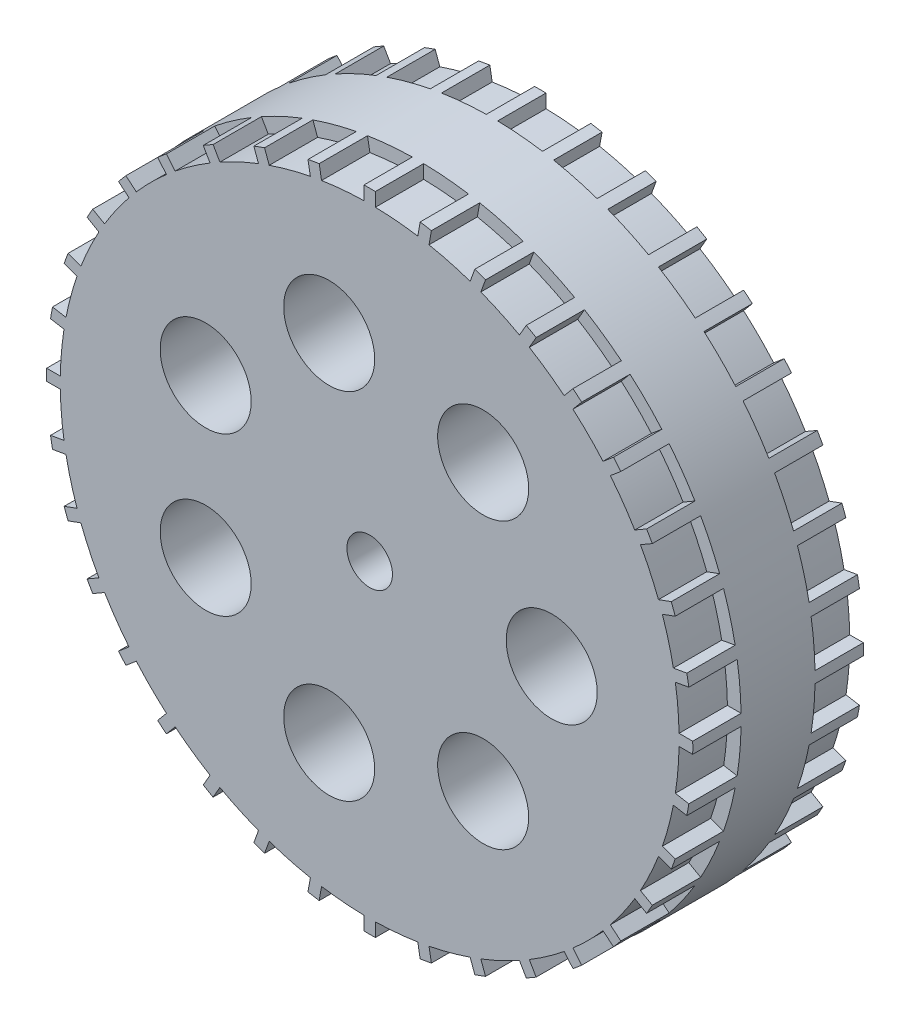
from build123d import *
from build123d.topology import SkipClean

# Parameters (mm, degrees)
SKETCH_1_R          = 27.2
EXTRUDE_1_DEPTH     = 15
CUT_EXTRUDE_1_DEPTH = 10
SKETCH_3_R          = 2
CUT_EXTRUDE_2_DEPTH = 11
SKETCH_6_R          = 4
CUT_EXTRUDE_5_DEPTH = 30
EXTRUDE_START       = -15
EXTRUDE_2_DEPTH     = 15
SKETCH_10_R         = 28.4
SKETCH_10_R_2       = 27.2
EXTRUDE_3_DEPTH     = 3.25


with BuildPart() as part:
    # Sketch 1 → Extrude 1 (new body)
    with BuildSketch(Plane.XY):
        Circle(SKETCH_1_R)
    extrude(amount=EXTRUDE_1_DEPTH)

    # Sketch 2 → Cut-Extrude 1 (cut)
    with BuildSketch(Plane(origin=(0, 0, 0), x_dir=(-1, 0, 0), z_dir=(0, 0, -1))):
        Polygon((7.043673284, 0), (3.521836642, 6.1), (-3.521836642, 6.1), (-7.043673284, 0), (-3.521836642, -6.1), (3.521836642, -6.1), align=None)
    extrude(amount=-CUT_EXTRUDE_1_DEPTH, mode=Mode.SUBTRACT)

    # Sketch 3 → Cut-Extrude 2 (cut)
    with BuildSketch(Plane(origin=(0, 0, 10), x_dir=(-1, 0, 0), z_dir=(0, 0, -1))):
        Circle(SKETCH_3_R)
    extrude(amount=-CUT_EXTRUDE_2_DEPTH, mode=Mode.SUBTRACT)

    # Sketch 6 → Cut-Extrude 5 (cut)
    with BuildSketch(Plane.XY.offset(15)):
        with Locations((16, 0)):
            Circle(SKETCH_6_R)
        with Locations((9.97583683, -12.509303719)):
            Circle(SKETCH_6_R)
        with Locations((-3.560334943, -15.598846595)):
            Circle(SKETCH_6_R)
        with Locations((-14.415501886, -6.942139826)):
            Circle(SKETCH_6_R)
        with Locations((-14.415501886, 6.942139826)):
            Circle(SKETCH_6_R)
        with Locations((-3.560334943, 15.598846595)):
            Circle(SKETCH_6_R)
        with Locations((9.97583683, 12.509303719)):
            Circle(SKETCH_6_R)
    extrude(amount=-CUT_EXTRUDE_5_DEPTH, mode=Mode.SUBTRACT)

    # Sketch 7 → Extrude 2 (add)
    with BuildSketch(Plane.XY.offset(15).offset(EXTRUDE_START)):
        with BuildLine():
            Line((-0.5, 28.39559825), (-0.5, 27.195404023))
            ThreePointArc((-0.5, 27.195404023), (0, 27.2), (0.5, 27.195404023))
            Line((0.5, 27.195404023), (0.5, 28.39559825))
            ThreePointArc((0.5, 28.39559825), (0, 28.4), (-0.5, 28.39559825))
        make_face()
        with BuildLine():
            Line((4.438440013, 28.051029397), (4.230028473, 26.869068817))
            ThreePointArc((4.230028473, 26.869068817), (4.723230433, 26.786770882), (5.214836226, 26.69542064))
            Line((5.214836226, 26.69542064), (5.423247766, 27.87738122))
            ThreePointArc((5.423247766, 27.87738122), (4.931608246, 27.968540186), (4.438440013, 28.051029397))
        make_face()
        with BuildLine():
            Line((9.242020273, 26.85414421), (8.831529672, 25.726330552))
            ThreePointArc((8.831529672, 25.726330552), (9.302947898, 25.559639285), (9.771222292, 25.384310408))
            Line((9.771222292, 25.384310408), (10.181712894, 26.512124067))
            ThreePointArc((10.181712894, 26.512124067), (9.71337207, 26.68727043), (9.242020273, 26.85414421))
        make_face()
        with BuildLine():
            Line((13.764786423, 24.841309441), (13.16468931, 23.801910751))
            ThreePointArc((13.16468931, 23.801910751), (13.6, 23.555890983), (14.030714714, 23.301910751))
            Line((14.030714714, 23.301910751), (14.630811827, 24.341309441))
            ThreePointArc((14.630811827, 24.341309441), (14.2, 24.595121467), (13.764786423, 24.841309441))
        make_face()
        with BuildLine():
            Line((17.869316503, 22.073684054), (17.097846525, 21.154281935))
            ThreePointArc((17.097846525, 21.154281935), (17.483822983, 20.836408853), (17.863890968, 20.511494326))
            Line((17.863890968, 20.511494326), (18.635360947, 21.430896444))
            ThreePointArc((18.635360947, 21.430896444), (18.255168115, 21.755662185), (17.869316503, 22.073684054))
        make_face()
        with BuildLine():
            Line((21.430896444, 18.635360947), (20.511494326, 17.863890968))
            ThreePointArc((20.511494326, 17.863890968), (20.836408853, 17.483822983), (21.154281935, 17.097846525))
            Line((21.154281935, 17.097846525), (22.073684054, 17.869316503))
            ThreePointArc((22.073684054, 17.869316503), (21.755662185, 18.255168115), (21.430896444, 18.635360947))
        make_face()
        with BuildLine():
            Line((24.341309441, 14.630811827), (23.301910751, 14.030714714))
            ThreePointArc((23.301910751, 14.030714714), (23.555890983, 13.6), (23.801910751, 13.16468931))
            Line((23.801910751, 13.16468931), (24.841309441, 13.764786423))
            ThreePointArc((24.841309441, 13.764786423), (24.595121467, 14.2), (24.341309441, 14.630811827))
        make_face()
        with BuildLine():
            Line((26.512124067, 10.181712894), (25.384310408, 9.771222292))
            ThreePointArc((25.384310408, 9.771222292), (25.559639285, 9.302947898), (25.726330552, 8.831529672))
            Line((25.726330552, 8.831529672), (26.85414421, 9.242020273))
            ThreePointArc((26.85414421, 9.242020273), (26.68727043, 9.71337207), (26.512124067, 10.181712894))
        make_face()
        with BuildLine():
            Line((27.87738122, 5.423247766), (26.69542064, 5.214836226))
            ThreePointArc((26.69542064, 5.214836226), (26.786770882, 4.723230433), (26.869068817, 4.230028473))
            Line((26.869068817, 4.230028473), (28.051029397, 4.438440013))
            ThreePointArc((28.051029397, 4.438440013), (27.968540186, 4.931608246), (27.87738122, 5.423247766))
        make_face()
        with BuildLine():
            Line((28.39559825, 0.5), (27.195404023, 0.5))
            ThreePointArc((27.195404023, 0.5), (27.2, 0), (27.195404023, -0.5))
            Line((27.195404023, -0.5), (28.39559825, -0.5))
            ThreePointArc((28.39559825, -0.5), (28.4, 0), (28.39559825, 0.5))
        make_face()
        with BuildLine():
            Line((28.051029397, -4.438440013), (26.869068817, -4.230028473))
            ThreePointArc((26.869068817, -4.230028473), (26.786770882, -4.723230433), (26.69542064, -5.214836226))
            Line((26.69542064, -5.214836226), (27.87738122, -5.423247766))
            ThreePointArc((27.87738122, -5.423247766), (27.968540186, -4.931608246), (28.051029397, -4.438440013))
        make_face()
        with BuildLine():
            Line((26.85414421, -9.242020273), (25.726330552, -8.831529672))
            ThreePointArc((25.726330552, -8.831529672), (25.559639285, -9.302947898), (25.384310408, -9.771222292))
            Line((25.384310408, -9.771222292), (26.512124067, -10.181712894))
            ThreePointArc((26.512124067, -10.181712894), (26.68727043, -9.71337207), (26.85414421, -9.242020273))
        make_face()
        with BuildLine():
            Line((24.841309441, -13.764786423), (23.801910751, -13.16468931))
            ThreePointArc((23.801910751, -13.16468931), (23.555890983, -13.6), (23.301910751, -14.030714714))
            Line((23.301910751, -14.030714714), (24.341309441, -14.630811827))
            ThreePointArc((24.341309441, -14.630811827), (24.595121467, -14.2), (24.841309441, -13.764786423))
        make_face()
        with BuildLine():
            Line((22.073684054, -17.869316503), (21.154281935, -17.097846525))
            ThreePointArc((21.154281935, -17.097846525), (20.836408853, -17.483822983), (20.511494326, -17.863890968))
            Line((20.511494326, -17.863890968), (21.430896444, -18.635360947))
            ThreePointArc((21.430896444, -18.635360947), (21.755662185, -18.255168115), (22.073684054, -17.869316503))
        make_face()
        with BuildLine():
            Line((18.635360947, -21.430896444), (17.863890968, -20.511494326))
            ThreePointArc((17.863890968, -20.511494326), (17.483822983, -20.836408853), (17.097846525, -21.154281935))
            Line((17.097846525, -21.154281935), (17.869316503, -22.073684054))
            ThreePointArc((17.869316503, -22.073684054), (18.255168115, -21.755662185), (18.635360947, -21.430896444))
        make_face()
        with BuildLine():
            Line((14.630811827, -24.341309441), (14.030714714, -23.301910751))
            ThreePointArc((14.030714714, -23.301910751), (13.6, -23.555890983), (13.16468931, -23.801910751))
            Line((13.16468931, -23.801910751), (13.764786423, -24.841309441))
            ThreePointArc((13.764786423, -24.841309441), (14.2, -24.595121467), (14.630811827, -24.341309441))
        make_face()
        with BuildLine():
            Line((10.181712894, -26.512124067), (9.771222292, -25.384310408))
            ThreePointArc((9.771222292, -25.384310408), (9.302947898, -25.559639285), (8.831529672, -25.726330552))
            Line((8.831529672, -25.726330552), (9.242020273, -26.85414421))
            ThreePointArc((9.242020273, -26.85414421), (9.71337207, -26.68727043), (10.181712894, -26.512124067))
        make_face()
        with BuildLine():
            Line((5.423247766, -27.87738122), (5.214836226, -26.69542064))
            ThreePointArc((5.214836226, -26.69542064), (4.723230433, -26.786770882), (4.230028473, -26.869068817))
            Line((4.230028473, -26.869068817), (4.438440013, -28.051029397))
            ThreePointArc((4.438440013, -28.051029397), (4.931608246, -27.968540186), (5.423247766, -27.87738122))
        make_face()
        with BuildLine():
            Line((0.5, -28.39559825), (0.5, -27.195404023))
            ThreePointArc((0.5, -27.195404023), (0, -27.2), (-0.5, -27.195404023))
            Line((-0.5, -27.195404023), (-0.5, -28.39559825))
            ThreePointArc((-0.5, -28.39559825), (0, -28.4), (0.5, -28.39559825))
        make_face()
        with BuildLine():
            Line((-4.438440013, -28.051029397), (-4.230028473, -26.869068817))
            ThreePointArc((-4.230028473, -26.869068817), (-4.723230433, -26.786770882), (-5.214836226, -26.69542064))
            Line((-5.214836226, -26.69542064), (-5.423247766, -27.87738122))
            ThreePointArc((-5.423247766, -27.87738122), (-4.931608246, -27.968540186), (-4.438440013, -28.051029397))
        make_face()
        with BuildLine():
            Line((-9.242020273, -26.85414421), (-8.831529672, -25.726330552))
            ThreePointArc((-8.831529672, -25.726330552), (-9.302947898, -25.559639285), (-9.771222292, -25.384310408))
            Line((-9.771222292, -25.384310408), (-10.181712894, -26.512124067))
            ThreePointArc((-10.181712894, -26.512124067), (-9.71337207, -26.68727043), (-9.242020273, -26.85414421))
        make_face()
        with BuildLine():
            Line((-13.764786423, -24.841309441), (-13.16468931, -23.801910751))
            ThreePointArc((-13.16468931, -23.801910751), (-13.6, -23.555890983), (-14.030714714, -23.301910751))
            Line((-14.030714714, -23.301910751), (-14.630811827, -24.341309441))
            ThreePointArc((-14.630811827, -24.341309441), (-14.2, -24.595121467), (-13.764786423, -24.841309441))
        make_face()
        with BuildLine():
            Line((-17.869316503, -22.073684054), (-17.097846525, -21.154281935))
            ThreePointArc((-17.097846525, -21.154281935), (-17.483822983, -20.836408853), (-17.863890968, -20.511494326))
            Line((-17.863890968, -20.511494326), (-18.635360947, -21.430896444))
            ThreePointArc((-18.635360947, -21.430896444), (-18.255168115, -21.755662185), (-17.869316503, -22.073684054))
        make_face()
        with BuildLine():
            Line((-21.430896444, -18.635360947), (-20.511494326, -17.863890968))
            ThreePointArc((-20.511494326, -17.863890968), (-20.836408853, -17.483822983), (-21.154281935, -17.097846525))
            Line((-21.154281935, -17.097846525), (-22.073684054, -17.869316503))
            ThreePointArc((-22.073684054, -17.869316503), (-21.755662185, -18.255168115), (-21.430896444, -18.635360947))
        make_face()
        with BuildLine():
            Line((-24.341309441, -14.630811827), (-23.301910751, -14.030714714))
            ThreePointArc((-23.301910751, -14.030714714), (-23.555890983, -13.6), (-23.801910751, -13.16468931))
            Line((-23.801910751, -13.16468931), (-24.841309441, -13.764786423))
            ThreePointArc((-24.841309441, -13.764786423), (-24.595121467, -14.2), (-24.341309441, -14.630811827))
        make_face()
        with BuildLine():
            Line((-26.512124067, -10.181712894), (-25.384310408, -9.771222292))
            ThreePointArc((-25.384310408, -9.771222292), (-25.559639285, -9.302947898), (-25.726330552, -8.831529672))
            Line((-25.726330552, -8.831529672), (-26.85414421, -9.242020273))
            ThreePointArc((-26.85414421, -9.242020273), (-26.68727043, -9.71337207), (-26.512124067, -10.181712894))
        make_face()
        with BuildLine():
            Line((-27.87738122, -5.423247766), (-26.69542064, -5.214836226))
            ThreePointArc((-26.69542064, -5.214836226), (-26.786770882, -4.723230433), (-26.869068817, -4.230028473))
            Line((-26.869068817, -4.230028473), (-28.051029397, -4.438440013))
            ThreePointArc((-28.051029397, -4.438440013), (-27.968540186, -4.931608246), (-27.87738122, -5.423247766))
        make_face()
        with BuildLine():
            Line((-28.39559825, -0.5), (-27.195404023, -0.5))
            ThreePointArc((-27.195404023, -0.5), (-27.2, 0), (-27.195404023, 0.5))
            Line((-27.195404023, 0.5), (-28.39559825, 0.5))
            ThreePointArc((-28.39559825, 0.5), (-28.4, 0), (-28.39559825, -0.5))
        make_face()
        with BuildLine():
            Line((-28.051029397, 4.438440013), (-26.869068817, 4.230028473))
            ThreePointArc((-26.869068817, 4.230028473), (-26.786770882, 4.723230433), (-26.69542064, 5.214836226))
            Line((-26.69542064, 5.214836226), (-27.87738122, 5.423247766))
            ThreePointArc((-27.87738122, 5.423247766), (-27.968540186, 4.931608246), (-28.051029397, 4.438440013))
        make_face()
        with BuildLine():
            Line((-26.85414421, 9.242020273), (-25.726330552, 8.831529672))
            ThreePointArc((-25.726330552, 8.831529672), (-25.559639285, 9.302947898), (-25.384310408, 9.771222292))
            Line((-25.384310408, 9.771222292), (-26.512124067, 10.181712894))
            ThreePointArc((-26.512124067, 10.181712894), (-26.68727043, 9.71337207), (-26.85414421, 9.242020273))
        make_face()
        with BuildLine():
            Line((-24.841309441, 13.764786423), (-23.801910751, 13.16468931))
            ThreePointArc((-23.801910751, 13.16468931), (-23.555890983, 13.6), (-23.301910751, 14.030714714))
            Line((-23.301910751, 14.030714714), (-24.341309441, 14.630811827))
            ThreePointArc((-24.341309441, 14.630811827), (-24.595121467, 14.2), (-24.841309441, 13.764786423))
        make_face()
        with BuildLine():
            Line((-22.073684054, 17.869316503), (-21.154281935, 17.097846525))
            ThreePointArc((-21.154281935, 17.097846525), (-20.836408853, 17.483822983), (-20.511494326, 17.863890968))
            Line((-20.511494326, 17.863890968), (-21.430896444, 18.635360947))
            ThreePointArc((-21.430896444, 18.635360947), (-21.755662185, 18.255168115), (-22.073684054, 17.869316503))
        make_face()
        with BuildLine():
            Line((-18.635360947, 21.430896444), (-17.863890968, 20.511494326))
            ThreePointArc((-17.863890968, 20.511494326), (-17.483822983, 20.836408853), (-17.097846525, 21.154281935))
            Line((-17.097846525, 21.154281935), (-17.869316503, 22.073684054))
            ThreePointArc((-17.869316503, 22.073684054), (-18.255168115, 21.755662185), (-18.635360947, 21.430896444))
        make_face()
        with BuildLine():
            Line((-14.630811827, 24.341309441), (-14.030714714, 23.301910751))
            ThreePointArc((-14.030714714, 23.301910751), (-13.6, 23.555890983), (-13.16468931, 23.801910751))
            Line((-13.16468931, 23.801910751), (-13.764786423, 24.841309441))
            ThreePointArc((-13.764786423, 24.841309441), (-14.2, 24.595121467), (-14.630811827, 24.341309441))
        make_face()
        with BuildLine():
            Line((-10.181712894, 26.512124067), (-9.771222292, 25.384310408))
            ThreePointArc((-9.771222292, 25.384310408), (-9.302947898, 25.559639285), (-8.831529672, 25.726330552))
            Line((-8.831529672, 25.726330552), (-9.242020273, 26.85414421))
            ThreePointArc((-9.242020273, 26.85414421), (-9.71337207, 26.68727043), (-10.181712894, 26.512124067))
        make_face()
        with BuildLine():
            Line((-5.423247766, 27.87738122), (-5.214836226, 26.69542064))
            ThreePointArc((-5.214836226, 26.69542064), (-4.723230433, 26.786770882), (-4.230028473, 26.869068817))
            Line((-4.230028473, 26.869068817), (-4.438440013, 28.051029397))
            ThreePointArc((-4.438440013, 28.051029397), (-4.931608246, 27.968540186), (-5.423247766, 27.87738122))
        make_face()
    extrude(amount=EXTRUDE_2_DEPTH)

    # Sketch 10 → Extrude 3 (add)
    with SkipClean():  # the faces are left unmerged after this step: merging them gives an invalid solid
        with BuildSketch(Plane.XY.offset(7.5)):
            with Locations(Location((0, 0, 0), (0, 0, 1.00878063))):
                Circle(SKETCH_10_R)
            Circle(SKETCH_10_R_2, mode=Mode.SUBTRACT)
        extrude_3 = extrude(amount=EXTRUDE_3_DEPTH)

    # Mirror 1: Extrude 3 across plane
    add(extrude_3.mirror(Plane.XY.offset(7.5)))


solid = part.part
